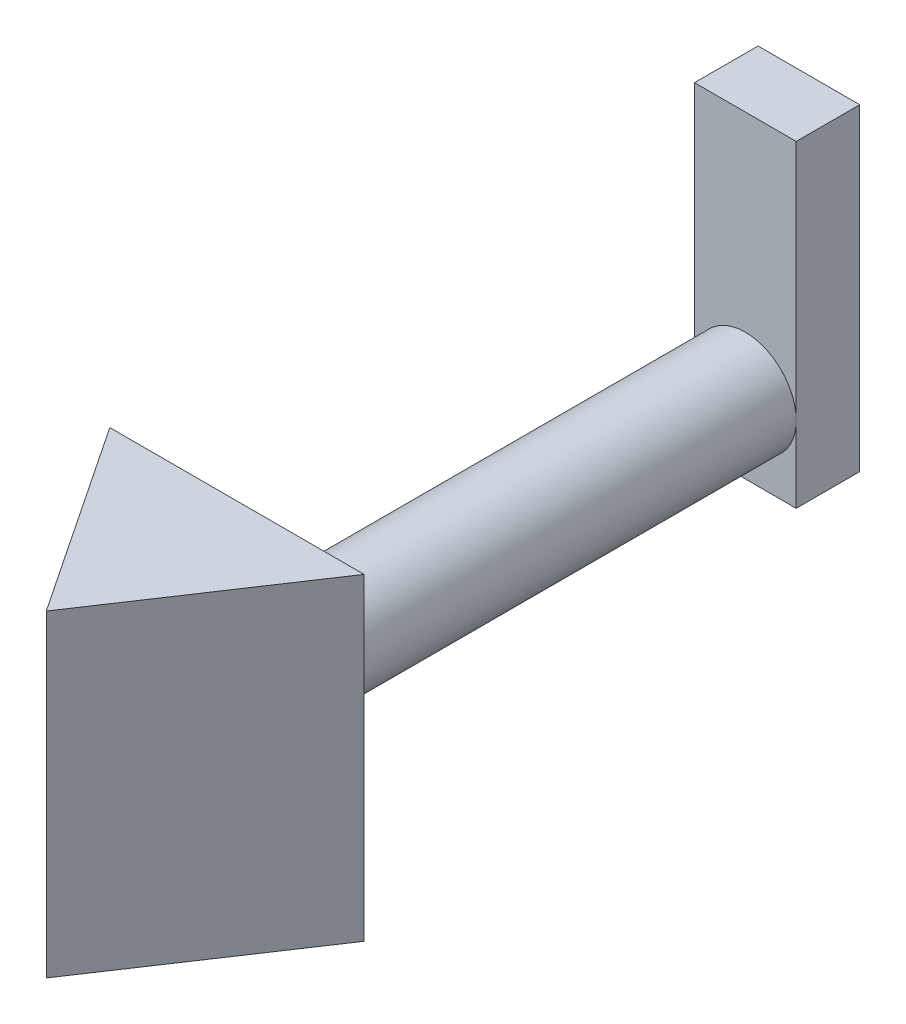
ISO-10303-21;
HEADER;
FILE_DESCRIPTION(('STEP AP214'),'2;1');
FILE_NAME('part.step','',(''),(''),'','','');
FILE_SCHEMA(('AUTOMOTIVE_DESIGN { 1 0 10303 214 1 1 1 1 }'));
ENDSEC;
DATA;
#1=APPLICATION_CONTEXT('core data for automotive mechanical design processes');
#2=APPLICATION_PROTOCOL_DEFINITION('international standard','automotive_design',2000,#1);
#3=PRODUCT_CONTEXT('',#1,'mechanical');
#4=PRODUCT('Part','Part','',(#3));
#5=PRODUCT_RELATED_PRODUCT_CATEGORY('part','',(#4));
#6=PRODUCT_DEFINITION_FORMATION('','',#4);
#7=PRODUCT_DEFINITION_CONTEXT('part definition',#1,'design');
#8=PRODUCT_DEFINITION('design','',#6,#7);
#9=PRODUCT_DEFINITION_SHAPE('','',#8);
#10=(LENGTH_UNIT() NAMED_UNIT(*) SI_UNIT(.MILLI.,.METRE.));
#11=(NAMED_UNIT(*) PLANE_ANGLE_UNIT() SI_UNIT($,.RADIAN.));
#12=(NAMED_UNIT(*) SI_UNIT($,.STERADIAN.) SOLID_ANGLE_UNIT());
#13=UNCERTAINTY_MEASURE_WITH_UNIT(LENGTH_MEASURE(1.E-05),#10,'distance_accuracy_value','');
#14=(GEOMETRIC_REPRESENTATION_CONTEXT(3) GLOBAL_UNCERTAINTY_ASSIGNED_CONTEXT((#13)) GLOBAL_UNIT_ASSIGNED_CONTEXT((#10,
#11,#12)) REPRESENTATION_CONTEXT('',''));
#15=CARTESIAN_POINT('',(0.,0.,0.));
#16=DIRECTION('',(0.,0.,1.));
#17=DIRECTION('',(1.,0.,0.));
#18=AXIS2_PLACEMENT_3D('',#15,#16,#17);
#19=CARTESIAN_POINT('',(0.,0.,80.));
#20=DIRECTION('',(0.,0.,-1.));
#21=DIRECTION('',(-1.,0.,0.));
#22=AXIS2_PLACEMENT_3D('',#19,#20,#21);
#23=CYLINDRICAL_SURFACE('',#22,8.);
#24=CARTESIAN_POINT('',(0.,0.,80.));
#25=DIRECTION('',(0.,0.,1.));
#26=DIRECTION('',(1.,0.,0.));
#27=AXIS2_PLACEMENT_3D('',#24,#25,#26);
#28=CIRCLE('',#27,8.);
#29=CARTESIAN_POINT('',(8.,0.,80.));
#30=VERTEX_POINT('',#29);
#31=EDGE_CURVE('E11',#30,#30,#28,.T.);
#32=ORIENTED_EDGE('',*,*,#31,.F.);
#33=EDGE_LOOP('',(#32));
#34=FACE_BOUND('',#33,.T.);
#35=CARTESIAN_POINT('',(0.,0.,0.));
#36=DIRECTION('',(0.,0.,1.));
#37=DIRECTION('',(1.,0.,0.));
#38=AXIS2_PLACEMENT_3D('',#35,#36,#37);
#39=CIRCLE('',#38,8.);
#40=CARTESIAN_POINT('',(8.,0.,0.));
#41=VERTEX_POINT('',#40);
#42=CARTESIAN_POINT('',(-8.,0.,0.));
#43=VERTEX_POINT('',#42);
#44=EDGE_CURVE('E36',#41,#43,#39,.T.);
#45=ORIENTED_EDGE('',*,*,#44,.T.);
#46=EDGE_CURVE('E54',#43,#41,#39,.T.);
#47=ORIENTED_EDGE('',*,*,#46,.T.);
#48=EDGE_LOOP('',(#45,#47));
#49=FACE_BOUND('',#48,.T.);
#50=ADVANCED_FACE('F33',(#34,#49),#23,.T.);
#51=CARTESIAN_POINT('',(8.,38.,0.));
#52=DIRECTION('',(0.,0.,1.));
#53=DIRECTION('',(1.,0.,0.));
#54=AXIS2_PLACEMENT_3D('',#51,#52,#53);
#55=PLANE('',#54);
#56=ORIENTED_EDGE('',*,*,#44,.F.);
#57=DIRECTION('',(0.,-1.,0.));
#58=VECTOR('',#57,1.);
#59=CARTESIAN_POINT('',(8.,-12.,0.));
#60=LINE('',#59,#58);
#61=CARTESIAN_POINT('',(8.,38.,0.));
#62=VERTEX_POINT('',#61);
#63=EDGE_CURVE('E47',#62,#41,#60,.T.);
#64=ORIENTED_EDGE('',*,*,#63,.F.);
#65=DIRECTION('',(1.,0.,0.));
#66=VECTOR('',#65,1.);
#67=CARTESIAN_POINT('',(8.,38.,0.));
#68=LINE('',#67,#66);
#69=CARTESIAN_POINT('',(-8.,38.,0.));
#70=VERTEX_POINT('',#69);
#71=EDGE_CURVE('E133',#70,#62,#68,.T.);
#72=ORIENTED_EDGE('',*,*,#71,.F.);
#73=DIRECTION('',(0.,1.,0.));
#74=VECTOR('',#73,1.);
#75=CARTESIAN_POINT('',(-8.,-12.,0.));
#76=LINE('',#75,#74);
#77=EDGE_CURVE('E142',#43,#70,#76,.T.);
#78=ORIENTED_EDGE('',*,*,#77,.F.);
#79=EDGE_LOOP('',(#56,#64,#72,#78));
#80=FACE_BOUND('',#79,.T.);
#81=ADVANCED_FACE('F162',(#80),#55,.T.);
#82=ORIENTED_EDGE('',*,*,#46,.F.);
#83=CARTESIAN_POINT('',(-8.,-12.,0.));
#84=VERTEX_POINT('',#83);
#85=EDGE_CURVE('E143',#84,#43,#76,.T.);
#86=ORIENTED_EDGE('',*,*,#85,.F.);
#87=DIRECTION('',(-1.,0.,0.));
#88=VECTOR('',#87,1.);
#89=CARTESIAN_POINT('',(8.,-12.,0.));
#90=LINE('',#89,#88);
#91=CARTESIAN_POINT('',(8.,-12.,0.));
#92=VERTEX_POINT('',#91);
#93=EDGE_CURVE('E140',#92,#84,#90,.T.);
#94=ORIENTED_EDGE('',*,*,#93,.F.);
#95=EDGE_CURVE('E122',#41,#92,#60,.T.);
#96=ORIENTED_EDGE('',*,*,#95,.F.);
#97=EDGE_LOOP('',(#82,#86,#94,#96));
#98=FACE_BOUND('',#97,.T.);
#99=ADVANCED_FACE('F170',(#98),#55,.T.);
#100=CARTESIAN_POINT('',(8.,-12.,-10.));
#101=DIRECTION('',(-1.,0.,0.));
#102=DIRECTION('',(0.,0.,1.));
#103=AXIS2_PLACEMENT_3D('',#100,#101,#102);
#104=PLANE('',#103);
#105=ORIENTED_EDGE('',*,*,#63,.T.);
#106=ORIENTED_EDGE('',*,*,#95,.T.);
#107=DIRECTION('',(0.,0.,1.));
#108=VECTOR('',#107,1.);
#109=CARTESIAN_POINT('',(8.,-12.,-10.));
#110=LINE('',#109,#108);
#111=CARTESIAN_POINT('',(8.,-12.,-10.));
#112=VERTEX_POINT('',#111);
#113=EDGE_CURVE('E154',#112,#92,#110,.T.);
#114=ORIENTED_EDGE('',*,*,#113,.F.);
#115=DIRECTION('',(0.,-1.,0.));
#116=VECTOR('',#115,1.);
#117=CARTESIAN_POINT('',(8.,-12.,-10.));
#118=LINE('',#117,#116);
#119=CARTESIAN_POINT('',(8.,38.,-10.));
#120=VERTEX_POINT('',#119);
#121=EDGE_CURVE('E129',#120,#112,#118,.T.);
#122=ORIENTED_EDGE('',*,*,#121,.F.);
#123=DIRECTION('',(0.,0.,1.));
#124=VECTOR('',#123,1.);
#125=CARTESIAN_POINT('',(8.,38.,-10.));
#126=LINE('',#125,#124);
#127=EDGE_CURVE('E138',#120,#62,#126,.T.);
#128=ORIENTED_EDGE('',*,*,#127,.T.);
#129=EDGE_LOOP('',(#105,#106,#114,#122,#128));
#130=FACE_BOUND('',#129,.T.);
#131=ADVANCED_FACE('F177',(#130),#104,.F.);
#132=CARTESIAN_POINT('',(8.,-12.,-10.));
#133=DIRECTION('',(0.,1.,0.));
#134=DIRECTION('',(0.,0.,1.));
#135=AXIS2_PLACEMENT_3D('',#132,#133,#134);
#136=PLANE('',#135);
#137=ORIENTED_EDGE('',*,*,#93,.T.);
#138=DIRECTION('',(0.,0.,1.));
#139=VECTOR('',#138,1.);
#140=CARTESIAN_POINT('',(-8.,-12.,-10.));
#141=LINE('',#140,#139);
#142=CARTESIAN_POINT('',(-8.,-12.,-10.));
#143=VERTEX_POINT('',#142);
#144=EDGE_CURVE('E151',#143,#84,#141,.T.);
#145=ORIENTED_EDGE('',*,*,#144,.F.);
#146=DIRECTION('',(-1.,0.,0.));
#147=VECTOR('',#146,1.);
#148=CARTESIAN_POINT('',(8.,-12.,-10.));
#149=LINE('',#148,#147);
#150=EDGE_CURVE('E132',#112,#143,#149,.T.);
#151=ORIENTED_EDGE('',*,*,#150,.F.);
#152=ORIENTED_EDGE('',*,*,#113,.T.);
#153=EDGE_LOOP('',(#137,#145,#151,#152));
#154=FACE_BOUND('',#153,.T.);
#155=ADVANCED_FACE('F171',(#154),#136,.F.);
#156=CARTESIAN_POINT('',(-8.,-12.,-10.));
#157=DIRECTION('',(1.,0.,0.));
#158=DIRECTION('',(0.,0.,-1.));
#159=AXIS2_PLACEMENT_3D('',#156,#157,#158);
#160=PLANE('',#159);
#161=ORIENTED_EDGE('',*,*,#85,.T.);
#162=ORIENTED_EDGE('',*,*,#77,.T.);
#163=DIRECTION('',(0.,0.,1.));
#164=VECTOR('',#163,1.);
#165=CARTESIAN_POINT('',(-8.,38.,-10.));
#166=LINE('',#165,#164);
#167=CARTESIAN_POINT('',(-8.,38.,-10.));
#168=VERTEX_POINT('',#167);
#169=EDGE_CURVE('E148',#168,#70,#166,.T.);
#170=ORIENTED_EDGE('',*,*,#169,.F.);
#171=DIRECTION('',(0.,1.,0.));
#172=VECTOR('',#171,1.);
#173=CARTESIAN_POINT('',(-8.,-12.,-10.));
#174=LINE('',#173,#172);
#175=EDGE_CURVE('E135',#143,#168,#174,.T.);
#176=ORIENTED_EDGE('',*,*,#175,.F.);
#177=ORIENTED_EDGE('',*,*,#144,.T.);
#178=EDGE_LOOP('',(#161,#162,#170,#176,#177));
#179=FACE_BOUND('',#178,.T.);
#180=ADVANCED_FACE('F166',(#179),#160,.F.);
#181=CARTESIAN_POINT('',(8.,38.,-10.));
#182=DIRECTION('',(0.,-1.,0.));
#183=DIRECTION('',(0.,0.,-1.));
#184=AXIS2_PLACEMENT_3D('',#181,#182,#183);
#185=PLANE('',#184);
#186=ORIENTED_EDGE('',*,*,#71,.T.);
#187=ORIENTED_EDGE('',*,*,#127,.F.);
#188=DIRECTION('',(1.,0.,0.));
#189=VECTOR('',#188,1.);
#190=CARTESIAN_POINT('',(8.,38.,-10.));
#191=LINE('',#190,#189);
#192=EDGE_CURVE('E137',#168,#120,#191,.T.);
#193=ORIENTED_EDGE('',*,*,#192,.F.);
#194=ORIENTED_EDGE('',*,*,#169,.T.);
#195=EDGE_LOOP('',(#186,#187,#193,#194));
#196=FACE_BOUND('',#195,.T.);
#197=ADVANCED_FACE('F199',(#196),#185,.F.);
#198=CARTESIAN_POINT('',(8.,38.,-10.));
#199=DIRECTION('',(0.,0.,1.));
#200=DIRECTION('',(1.,0.,0.));
#201=AXIS2_PLACEMENT_3D('',#198,#199,#200);
#202=PLANE('',#201);
#203=ORIENTED_EDGE('',*,*,#121,.T.);
#204=ORIENTED_EDGE('',*,*,#150,.T.);
#205=ORIENTED_EDGE('',*,*,#175,.T.);
#206=ORIENTED_EDGE('',*,*,#192,.T.);
#207=EDGE_LOOP('',(#203,#204,#205,#206));
#208=FACE_BOUND('',#207,.T.);
#209=ADVANCED_FACE('F174',(#208),#202,.F.);
#210=CARTESIAN_POINT('',(0.,25.,80.));
#211=DIRECTION('',(0.,0.,1.));
#212=DIRECTION('',(1.,0.,0.));
#213=AXIS2_PLACEMENT_3D('',#210,#211,#212);
#214=PLANE('',#213);
#215=DIRECTION('',(-1.,0.,0.));
#216=VECTOR('',#215,1.);
#217=CARTESIAN_POINT('',(0.,-25.,80.));
#218=LINE('',#217,#216);
#219=CARTESIAN_POINT('',(20.,-25.,80.));
#220=VERTEX_POINT('',#219);
#221=CARTESIAN_POINT('',(-20.,-25.,80.));
#222=VERTEX_POINT('',#221);
#223=EDGE_CURVE('E116',#220,#222,#218,.T.);
#224=ORIENTED_EDGE('',*,*,#223,.T.);
#225=DIRECTION('',(0.,-1.,0.));
#226=VECTOR('',#225,1.);
#227=CARTESIAN_POINT('',(-20.,25.,80.));
#228=LINE('',#227,#226);
#229=CARTESIAN_POINT('',(-20.,25.,80.));
#230=VERTEX_POINT('',#229);
#231=EDGE_CURVE('E103',#230,#222,#228,.T.);
#232=ORIENTED_EDGE('',*,*,#231,.F.);
#233=DIRECTION('',(-1.,0.,0.));
#234=VECTOR('',#233,1.);
#235=CARTESIAN_POINT('',(-20.,25.,80.));
#236=LINE('',#235,#234);
#237=CARTESIAN_POINT('',(20.,25.,80.));
#238=VERTEX_POINT('',#237);
#239=EDGE_CURVE('E110',#238,#230,#236,.T.);
#240=ORIENTED_EDGE('',*,*,#239,.F.);
#241=DIRECTION('',(0.,-1.,0.));
#242=VECTOR('',#241,1.);
#243=CARTESIAN_POINT('',(20.,25.,80.));
#244=LINE('',#243,#242);
#245=EDGE_CURVE('E125',#238,#220,#244,.T.);
#246=ORIENTED_EDGE('',*,*,#245,.T.);
#247=EDGE_LOOP('',(#224,#232,#240,#246));
#248=FACE_BOUND('',#247,.T.);
#249=ORIENTED_EDGE('',*,*,#31,.T.);
#250=EDGE_LOOP('',(#249));
#251=FACE_BOUND('',#250,.T.);
#252=ADVANCED_FACE('F118',(#248,#251),#214,.F.);
#253=CARTESIAN_POINT('',(0.,25.,110.));
#254=DIRECTION('',(0.832050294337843,0.,-0.554700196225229));
#255=DIRECTION('',(-0.554700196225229,0.,-0.832050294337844));
#256=AXIS2_PLACEMENT_3D('',#253,#254,#255);
#257=PLANE('',#256);
#258=DIRECTION('',(0.554700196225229,0.,0.832050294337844));
#259=VECTOR('',#258,1.);
#260=CARTESIAN_POINT('',(0.,-25.,110.));
#261=LINE('',#260,#259);
#262=CARTESIAN_POINT('',(0.,-25.,110.));
#263=VERTEX_POINT('',#262);
#264=EDGE_CURVE('E261',#222,#263,#261,.T.);
#265=ORIENTED_EDGE('',*,*,#264,.T.);
#266=DIRECTION('',(0.,-1.,0.));
#267=VECTOR('',#266,1.);
#268=CARTESIAN_POINT('',(0.,25.,110.));
#269=LINE('',#268,#267);
#270=CARTESIAN_POINT('',(0.,25.,110.));
#271=VERTEX_POINT('',#270);
#272=EDGE_CURVE('E105',#271,#263,#269,.T.);
#273=ORIENTED_EDGE('',*,*,#272,.F.);
#274=DIRECTION('',(0.554700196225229,0.,0.832050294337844));
#275=VECTOR('',#274,1.);
#276=CARTESIAN_POINT('',(0.,25.,110.));
#277=LINE('',#276,#275);
#278=EDGE_CURVE('E99',#230,#271,#277,.T.);
#279=ORIENTED_EDGE('',*,*,#278,.F.);
#280=ORIENTED_EDGE('',*,*,#231,.T.);
#281=EDGE_LOOP('',(#265,#273,#279,#280));
#282=FACE_BOUND('',#281,.T.);
#283=ADVANCED_FACE('F101',(#282),#257,.F.);
#284=CARTESIAN_POINT('',(20.,25.,80.));
#285=DIRECTION('',(-0.832050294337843,0.,-0.554700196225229));
#286=DIRECTION('',(-0.554700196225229,0.,0.832050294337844));
#287=AXIS2_PLACEMENT_3D('',#284,#285,#286);
#288=PLANE('',#287);
#289=DIRECTION('',(0.554700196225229,0.,-0.832050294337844));
#290=VECTOR('',#289,1.);
#291=CARTESIAN_POINT('',(20.,-25.,80.));
#292=LINE('',#291,#290);
#293=EDGE_CURVE('E262',#263,#220,#292,.T.);
#294=ORIENTED_EDGE('',*,*,#293,.T.);
#295=ORIENTED_EDGE('',*,*,#245,.F.);
#296=DIRECTION('',(0.554700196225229,0.,-0.832050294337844));
#297=VECTOR('',#296,1.);
#298=CARTESIAN_POINT('',(20.,25.,80.));
#299=LINE('',#298,#297);
#300=EDGE_CURVE('E109',#271,#238,#299,.T.);
#301=ORIENTED_EDGE('',*,*,#300,.F.);
#302=ORIENTED_EDGE('',*,*,#272,.T.);
#303=EDGE_LOOP('',(#294,#295,#301,#302));
#304=FACE_BOUND('',#303,.T.);
#305=ADVANCED_FACE('F197',(#304),#288,.F.);
#306=CARTESIAN_POINT('',(20.,25.,80.));
#307=DIRECTION('',(0.,-1.,0.));
#308=DIRECTION('',(0.,0.,-1.));
#309=AXIS2_PLACEMENT_3D('',#306,#307,#308);
#310=PLANE('',#309);
#311=ORIENTED_EDGE('',*,*,#239,.T.);
#312=ORIENTED_EDGE('',*,*,#278,.T.);
#313=ORIENTED_EDGE('',*,*,#300,.T.);
#314=EDGE_LOOP('',(#311,#312,#313));
#315=FACE_BOUND('',#314,.T.);
#316=ADVANCED_FACE('F112',(#315),#310,.F.);
#317=CARTESIAN_POINT('',(20.,-25.,80.));
#318=DIRECTION('',(0.,-1.,0.));
#319=DIRECTION('',(0.,0.,-1.));
#320=AXIS2_PLACEMENT_3D('',#317,#318,#319);
#321=PLANE('',#320);
#322=ORIENTED_EDGE('',*,*,#264,.F.);
#323=ORIENTED_EDGE('',*,*,#223,.F.);
#324=ORIENTED_EDGE('',*,*,#293,.F.);
#325=EDGE_LOOP('',(#322,#323,#324));
#326=FACE_BOUND('',#325,.T.);
#327=ADVANCED_FACE('F203',(#326),#321,.T.);
#328=CLOSED_SHELL('',(#50,#81,#99,#131,#155,#180,#197,#209,#252,#283,#305,#316,#327));
#329=MANIFOLD_SOLID_BREP('B2',#328);
#330=ADVANCED_BREP_SHAPE_REPRESENTATION('',(#18,#329),#14);
#331=SHAPE_DEFINITION_REPRESENTATION(#9,#330);
ENDSEC;
END-ISO-10303-21;
